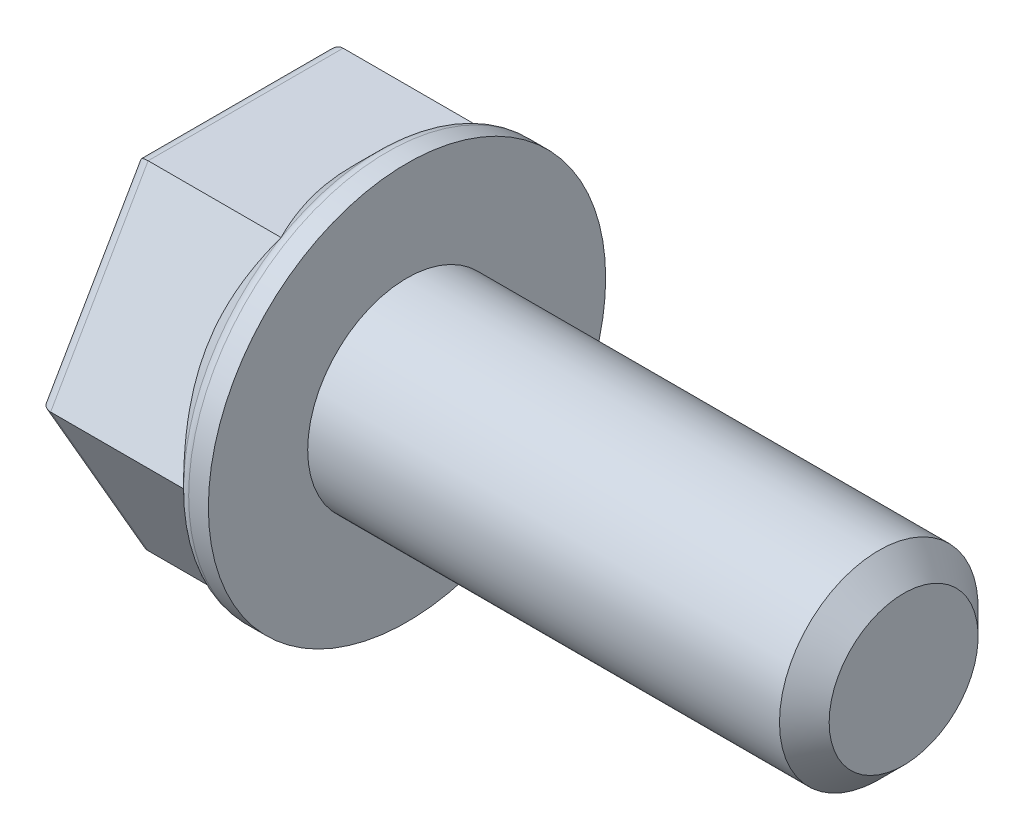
ISO-10303-21;
HEADER;
FILE_DESCRIPTION(('STEP AP214'),'2;1');
FILE_NAME('part.step','',(''),(''),'','','');
FILE_SCHEMA(('AUTOMOTIVE_DESIGN { 1 0 10303 214 1 1 1 1 }'));
ENDSEC;
DATA;
#1=APPLICATION_CONTEXT('core data for automotive mechanical design processes');
#2=APPLICATION_PROTOCOL_DEFINITION('international standard','automotive_design',2000,#1);
#3=PRODUCT_CONTEXT('',#1,'mechanical');
#4=PRODUCT('Part','Part','',(#3));
#5=PRODUCT_RELATED_PRODUCT_CATEGORY('part','',(#4));
#6=PRODUCT_DEFINITION_FORMATION('','',#4);
#7=PRODUCT_DEFINITION_CONTEXT('part definition',#1,'design');
#8=PRODUCT_DEFINITION('design','',#6,#7);
#9=PRODUCT_DEFINITION_SHAPE('','',#8);
#10=(LENGTH_UNIT() NAMED_UNIT(*) SI_UNIT(.MILLI.,.METRE.));
#11=(NAMED_UNIT(*) PLANE_ANGLE_UNIT() SI_UNIT($,.RADIAN.));
#12=(NAMED_UNIT(*) SI_UNIT($,.STERADIAN.) SOLID_ANGLE_UNIT());
#13=UNCERTAINTY_MEASURE_WITH_UNIT(LENGTH_MEASURE(1.E-05),#10,'distance_accuracy_value','');
#14=(GEOMETRIC_REPRESENTATION_CONTEXT(3) GLOBAL_UNCERTAINTY_ASSIGNED_CONTEXT((#13)) GLOBAL_UNIT_ASSIGNED_CONTEXT((#10,
#11,#12)) REPRESENTATION_CONTEXT('',''));
#15=CARTESIAN_POINT('',(0.,0.,0.));
#16=DIRECTION('',(0.,0.,1.));
#17=DIRECTION('',(1.,0.,0.));
#18=AXIS2_PLACEMENT_3D('',#15,#16,#17);
#19=CARTESIAN_POINT('',(-3.5,0.,0.));
#20=DIRECTION('',(-1.,0.,0.));
#21=DIRECTION('',(0.,0.,1.));
#22=AXIS2_PLACEMENT_3D('',#19,#20,#21);
#23=PLANE('',#22);
#24=CARTESIAN_POINT('',(-3.5,0.,0.));
#25=DIRECTION('',(-1.,0.,0.));
#26=DIRECTION('',(0.,0.,1.));
#27=AXIS2_PLACEMENT_3D('',#24,#25,#26);
#28=CIRCLE('',#27,3.10355339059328);
#29=CARTESIAN_POINT('',(-3.5,0.,3.10355339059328));
#30=VERTEX_POINT('',#29);
#31=EDGE_CURVE('E235',#30,#30,#28,.F.);
#32=ORIENTED_EDGE('',*,*,#31,.T.);
#33=EDGE_LOOP('',(#32));
#34=FACE_BOUND('',#33,.T.);
#35=DIRECTION('',(0.,0.,-1.));
#36=VECTOR('',#35,1.);
#37=CARTESIAN_POINT('',(-3.5,3.15000000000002,0.));
#38=LINE('',#37,#36);
#39=CARTESIAN_POINT('',(-3.5,3.15,1.81865334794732));
#40=VERTEX_POINT('',#39);
#41=CARTESIAN_POINT('',(-3.5,3.15000000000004,-1.81865334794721));
#42=VERTEX_POINT('',#41);
#43=EDGE_CURVE('E230',#40,#42,#38,.T.);
#44=ORIENTED_EDGE('',*,*,#43,.T.);
#45=DIRECTION('',(0.,0.866025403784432,0.500000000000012));
#46=VECTOR('',#45,1.);
#47=CARTESIAN_POINT('',(-3.5,-0.125000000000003,-3.70947547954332));
#48=LINE('',#47,#46);
#49=CARTESIAN_POINT('',(-3.5,0.,-3.63730669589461));
#50=VERTEX_POINT('',#49);
#51=EDGE_CURVE('E232',#42,#50,#48,.F.);
#52=ORIENTED_EDGE('',*,*,#51,.T.);
#53=DIRECTION('',(0.,-0.866025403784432,0.500000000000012));
#54=VECTOR('',#53,1.);
#55=CARTESIAN_POINT('',(-3.5,-1.57500000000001,-2.72798002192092));
#56=LINE('',#55,#54);
#57=CARTESIAN_POINT('',(-3.5,-3.15000000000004,-1.81865334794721));
#58=VERTEX_POINT('',#57);
#59=EDGE_CURVE('E216',#50,#58,#56,.T.);
#60=ORIENTED_EDGE('',*,*,#59,.T.);
#61=DIRECTION('',(0.,0.,-1.));
#62=VECTOR('',#61,1.);
#63=CARTESIAN_POINT('',(-3.5,-3.15,1.96299091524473));
#64=LINE('',#63,#62);
#65=CARTESIAN_POINT('',(-3.5,-3.15,1.81865334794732));
#66=VERTEX_POINT('',#65);
#67=EDGE_CURVE('E219',#58,#66,#64,.F.);
#68=ORIENTED_EDGE('',*,*,#67,.T.);
#69=DIRECTION('',(0.,-0.86602540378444,-0.499999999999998));
#70=VECTOR('',#69,1.);
#71=CARTESIAN_POINT('',(-3.5,0.125,3.70947547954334));
#72=LINE('',#71,#70);
#73=CARTESIAN_POINT('',(-3.5,0.,3.63730669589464));
#74=VERTEX_POINT('',#73);
#75=EDGE_CURVE('E226',#66,#74,#72,.F.);
#76=ORIENTED_EDGE('',*,*,#75,.T.);
#77=DIRECTION('',(0.,0.86602540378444,-0.499999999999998));
#78=VECTOR('',#77,1.);
#79=CARTESIAN_POINT('',(-3.5,1.57499999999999,2.72798002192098));
#80=LINE('',#79,#78);
#81=EDGE_CURVE('E228',#74,#40,#80,.T.);
#82=ORIENTED_EDGE('',*,*,#81,.T.);
#83=EDGE_LOOP('',(#44,#52,#60,#68,#76,#82));
#84=FACE_BOUND('',#83,.T.);
#85=ADVANCED_FACE('F34',(#34,#84),#23,.T.);
#86=CARTESIAN_POINT('',(-1.5,0.,0.));
#87=DIRECTION('',(1.,0.,0.));
#88=DIRECTION('',(0.,0.,-1.));
#89=AXIS2_PLACEMENT_3D('',#86,#87,#88);
#90=CONICAL_SURFACE('',#89,3.,0.785398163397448);
#91=CARTESIAN_POINT('',(-0.573223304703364,0.,0.));
#92=DIRECTION('',(-1.,0.,0.));
#93=DIRECTION('',(0.,0.,1.));
#94=AXIS2_PLACEMENT_3D('',#91,#92,#93);
#95=CIRCLE('',#94,3.92677669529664);
#96=CARTESIAN_POINT('',(-0.573223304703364,0.,3.92677669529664));
#97=VERTEX_POINT('',#96);
#98=EDGE_CURVE('E43',#97,#97,#95,.T.);
#99=ORIENTED_EDGE('',*,*,#98,.T.);
#100=EDGE_LOOP('',(#99));
#101=FACE_BOUND('',#100,.T.);
#102=CARTESIAN_POINT('',(-0.573902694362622,0.0002,-3.92609730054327));
#103=CARTESIAN_POINT('',(-0.641319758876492,-0.116671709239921,-3.85862138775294));
#104=CARTESIAN_POINT('',(-0.704777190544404,-0.23549764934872,-3.79001719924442));
#105=CARTESIAN_POINT('',(-0.820966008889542,-0.47779664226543,-3.65012581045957));
#106=CARTESIAN_POINT('',(-0.873632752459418,-0.60129273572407,-3.57882530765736));
#107=CARTESIAN_POINT('',(-0.963851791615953,-0.850316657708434,-3.43505127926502));
#108=CARTESIAN_POINT('',(-1.00163083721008,-0.975781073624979,-3.36261436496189));
#109=CARTESIAN_POINT('',(-1.05983713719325,-1.22947191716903,-3.21614588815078));
#110=CARTESIAN_POINT('',(-1.08030783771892,-1.35769059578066,-3.14211879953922));
#111=CARTESIAN_POINT('',(-1.09877789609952,-1.57867115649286,-3.01453561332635));
#112=CARTESIAN_POINT('',(-1.10151193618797,-1.67114767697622,-2.96114426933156));
#113=CARTESIAN_POINT('',(-1.09690453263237,-1.85595028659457,-2.85444843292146));
#114=CARTESIAN_POINT('',(-1.08955955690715,-1.94827631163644,-2.80114397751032));
#115=CARTESIAN_POINT('',(-1.06521350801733,-2.13205366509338,-2.695040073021));
#116=CARTESIAN_POINT('',(-1.04820163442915,-2.22350389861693,-2.64224125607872));
#117=CARTESIAN_POINT('',(-1.0054503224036,-2.40483373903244,-2.53755042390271));
#118=CARTESIAN_POINT('',(-0.979711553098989,-2.49471346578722,-2.48565833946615));
#119=CARTESIAN_POINT('',(-0.926755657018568,-2.65427457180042,-2.39353569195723));
#120=CARTESIAN_POINT('',(-0.900930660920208,-2.72430916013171,-2.35310120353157));
#121=CARTESIAN_POINT('',(-0.845118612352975,-2.8631210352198,-2.27295813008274));
#122=CARTESIAN_POINT('',(-0.815131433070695,-2.93189828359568,-2.23324956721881));
#123=CARTESIAN_POINT('',(-0.751667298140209,-3.06797879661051,-2.15468344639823));
#124=CARTESIAN_POINT('',(-0.71820131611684,-3.13528593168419,-2.11582365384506));
#125=CARTESIAN_POINT('',(-0.648219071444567,-3.26865369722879,-2.03882373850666));
#126=CARTESIAN_POINT('',(-0.611704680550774,-3.33471506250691,-2.0006831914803));
#127=CARTESIAN_POINT('',(-0.573902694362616,-3.40020000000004,-1.96287544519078));
#128=B_SPLINE_CURVE_WITH_KNOTS('',3,(#102,#103,#104,#105,#106,#107,#108,#109,#110,#111,#112,
#113,#114,#115,#116,#117,#118,#119,#120,#121,#122,#123,#124,#125,#126,#127),.UNSPECIFIED.,.F.,
.F.,(4,2,2,2,2,2,2,2,2,2,2,2,4),(0.,0.452876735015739,0.9083919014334,1.35667302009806,
1.80382552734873,2.12382555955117,2.44393776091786,2.76440831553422,3.08485430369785,
3.33941214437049,3.59397774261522,3.84776339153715,4.10139434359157),.UNSPECIFIED.);
#129=CARTESIAN_POINT('',(-0.574018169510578,0.,-3.92598183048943));
#130=VERTEX_POINT('',#129);
#131=CARTESIAN_POINT('',(-0.574018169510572,-3.40000000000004,-1.96299091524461));
#132=VERTEX_POINT('',#131);
#133=EDGE_CURVE('E173',#130,#132,#128,.T.);
#134=ORIENTED_EDGE('',*,*,#133,.F.);
#135=CARTESIAN_POINT('',(-0.573902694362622,-0.0002,-3.92609730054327));
#136=CARTESIAN_POINT('',(-0.641319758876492,0.116671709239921,-3.85862138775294));
#137=CARTESIAN_POINT('',(-0.704777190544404,0.23549764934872,-3.79001719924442));
#138=CARTESIAN_POINT('',(-0.820966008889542,0.47779664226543,-3.65012581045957));
#139=CARTESIAN_POINT('',(-0.873632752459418,0.60129273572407,-3.57882530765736));
#140=CARTESIAN_POINT('',(-0.963851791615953,0.850316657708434,-3.43505127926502));
#141=CARTESIAN_POINT('',(-1.00163083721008,0.975781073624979,-3.36261436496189));
#142=CARTESIAN_POINT('',(-1.05983713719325,1.22947191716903,-3.21614588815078));
#143=CARTESIAN_POINT('',(-1.08030783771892,1.35769059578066,-3.14211879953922));
#144=CARTESIAN_POINT('',(-1.09877789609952,1.57867115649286,-3.01453561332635));
#145=CARTESIAN_POINT('',(-1.10151193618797,1.67114767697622,-2.96114426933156));
#146=CARTESIAN_POINT('',(-1.09690453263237,1.85595028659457,-2.85444843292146));
#147=CARTESIAN_POINT('',(-1.08955955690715,1.94827631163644,-2.80114397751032));
#148=CARTESIAN_POINT('',(-1.06521350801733,2.13205366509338,-2.695040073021));
#149=CARTESIAN_POINT('',(-1.04820163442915,2.22350389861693,-2.64224125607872));
#150=CARTESIAN_POINT('',(-1.0054503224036,2.40483373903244,-2.53755042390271));
#151=CARTESIAN_POINT('',(-0.979711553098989,2.49471346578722,-2.48565833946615));
#152=CARTESIAN_POINT('',(-0.926755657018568,2.65427457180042,-2.39353569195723));
#153=CARTESIAN_POINT('',(-0.900930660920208,2.72430916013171,-2.35310120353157));
#154=CARTESIAN_POINT('',(-0.845118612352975,2.8631210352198,-2.27295813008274));
#155=CARTESIAN_POINT('',(-0.815131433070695,2.93189828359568,-2.23324956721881));
#156=CARTESIAN_POINT('',(-0.751667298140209,3.06797879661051,-2.15468344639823));
#157=CARTESIAN_POINT('',(-0.71820131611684,3.13528593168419,-2.11582365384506));
#158=CARTESIAN_POINT('',(-0.648219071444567,3.26865369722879,-2.03882373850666));
#159=CARTESIAN_POINT('',(-0.611704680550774,3.33471506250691,-2.0006831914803));
#160=CARTESIAN_POINT('',(-0.573902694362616,3.40020000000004,-1.96287544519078));
#161=B_SPLINE_CURVE_WITH_KNOTS('',3,(#135,#136,#137,#138,#139,#140,#141,#142,#143,#144,#145,
#146,#147,#148,#149,#150,#151,#152,#153,#154,#155,#156,#157,#158,#159,#160),.UNSPECIFIED.,.F.,
.F.,(4,2,2,2,2,2,2,2,2,2,2,2,4),(0.,0.452876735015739,0.9083919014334,1.35667302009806,
1.80382552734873,2.12382555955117,2.44393776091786,2.76440831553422,3.08485430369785,
3.33941214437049,3.59397774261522,3.84776339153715,4.10139434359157),.UNSPECIFIED.);
#162=CARTESIAN_POINT('',(-0.574018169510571,3.40000000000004,-1.96299091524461));
#163=VERTEX_POINT('',#162);
#164=EDGE_CURVE('E166',#130,#163,#161,.T.);
#165=ORIENTED_EDGE('',*,*,#164,.T.);
#166=CARTESIAN_POINT('',(0.724042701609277,3.40000000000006,-3.96618483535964));
#167=CARTESIAN_POINT('',(0.650912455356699,3.40000000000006,-3.86983982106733));
#168=CARTESIAN_POINT('',(0.578473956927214,3.40000000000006,-3.7729611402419));
#169=CARTESIAN_POINT('',(0.435291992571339,3.40000000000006,-3.57792374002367));
#170=CARTESIAN_POINT('',(0.364548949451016,3.40000000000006,-3.47976471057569));
#171=CARTESIAN_POINT('',(0.224566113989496,3.40000000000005,-3.28123579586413));
#172=CARTESIAN_POINT('',(0.155342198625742,3.40000000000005,-3.18085467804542));
#173=CARTESIAN_POINT('',(0.0194269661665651,3.40000000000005,-2.97839764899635));
#174=CARTESIAN_POINT('',(-0.0472645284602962,3.40000000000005,-2.87632185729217));
#175=CARTESIAN_POINT('',(-0.18138517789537,3.40000000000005,-2.66413015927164));
#176=CARTESIAN_POINT('',(-0.248626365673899,3.40000000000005,-2.55389483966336));
#177=CARTESIAN_POINT('',(-0.378758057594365,3.40000000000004,-2.33084584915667));
#178=CARTESIAN_POINT('',(-0.441647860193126,3.40000000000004,-2.21803176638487));
#179=CARTESIAN_POINT('',(-0.561724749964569,3.40000000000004,-1.98982394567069));
#180=CARTESIAN_POINT('',(-0.618928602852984,3.40000000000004,-1.87443909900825));
#181=CARTESIAN_POINT('',(-0.726352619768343,3.40000000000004,-1.64048900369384));
#182=CARTESIAN_POINT('',(-0.776575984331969,3.40000000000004,-1.52192524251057));
#183=CARTESIAN_POINT('',(-0.864306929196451,3.40000000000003,-1.29173731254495));
#184=CARTESIAN_POINT('',(-0.902535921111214,3.40000000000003,-1.18039095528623));
#185=CARTESIAN_POINT('',(-0.970067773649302,3.40000000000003,-0.954972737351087));
#186=CARTESIAN_POINT('',(-0.999370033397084,3.40000000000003,-0.840900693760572));
#187=CARTESIAN_POINT('',(-1.04701510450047,3.40000000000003,-0.612634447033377));
#188=CARTESIAN_POINT('',(-1.06554884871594,3.40000000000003,-0.498480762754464));
#189=CARTESIAN_POINT('',(-1.09128902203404,3.40000000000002,-0.268896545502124));
#190=CARTESIAN_POINT('',(-1.09849750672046,3.40000000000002,-0.153466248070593));
#191=CARTESIAN_POINT('',(-1.10102911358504,3.40000000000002,0.0731088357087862));
#192=CARTESIAN_POINT('',(-1.09679596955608,3.40000000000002,0.18424879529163));
#193=CARTESIAN_POINT('',(-1.07766937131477,3.40000000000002,0.40560151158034));
#194=CARTESIAN_POINT('',(-1.06277489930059,3.40000000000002,0.515814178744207));
#195=CARTESIAN_POINT('',(-1.02289334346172,3.40000000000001,0.736378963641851));
#196=CARTESIAN_POINT('',(-0.997732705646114,3.40000000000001,0.846699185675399));
#197=CARTESIAN_POINT('',(-0.938675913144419,3.40000000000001,1.06492923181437));
#198=CARTESIAN_POINT('',(-0.904780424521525,3.40000000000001,1.1728392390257));
#199=CARTESIAN_POINT('',(-0.826580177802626,3.40000000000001,1.39488118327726));
#200=CARTESIAN_POINT('',(-0.7816462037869,3.4,1.50878918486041));
#201=CARTESIAN_POINT('',(-0.684871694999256,3.4,1.73364085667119));
#202=CARTESIAN_POINT('',(-0.633028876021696,3.4,1.84458353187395));
#203=CARTESIAN_POINT('',(-0.523660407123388,3.4,2.06406368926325));
#204=CARTESIAN_POINT('',(-0.466116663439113,3.4,2.17259208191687));
#205=CARTESIAN_POINT('',(-0.346619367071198,3.4,2.38715476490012));
#206=CARTESIAN_POINT('',(-0.284666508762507,3.39999999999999,2.49318944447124));
#207=CARTESIAN_POINT('',(-0.160379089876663,3.39999999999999,2.69788580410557));
#208=CARTESIAN_POINT('',(-0.0982161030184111,3.39999999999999,2.7966522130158));
#209=CARTESIAN_POINT('',(0.0287343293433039,3.39999999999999,2.99248898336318));
#210=CARTESIAN_POINT('',(0.0935219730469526,3.39999999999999,3.08955921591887));
#211=CARTESIAN_POINT('',(0.224720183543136,3.39999999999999,3.28144047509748));
#212=CARTESIAN_POINT('',(0.291113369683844,3.39999999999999,3.37626342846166));
#213=CARTESIAN_POINT('',(0.425663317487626,3.39999999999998,3.56461182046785));
#214=CARTESIAN_POINT('',(0.493819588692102,3.39999999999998,3.65813760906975));
#215=CARTESIAN_POINT('',(0.562696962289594,3.39999999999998,3.75111990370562));
#216=B_SPLINE_CURVE_WITH_KNOTS('',3,(#166,#167,#168,#169,#170,#171,#172,#173,#174,#175,#176,
#177,#178,#179,#180,#181,#182,#183,#184,#185,#186,#187,#188,#189,#190,#191,#192,#193,#194,#195,
#196,#197,#198,#199,#200,#201,#202,#203,#204,#205,#206,#207,#208,#209,#210,#211,#212,#213,#214,
#215),.UNSPECIFIED.,.F.,.F.,(4,2,2,2,2,2,2,2,2,2,2,2,2,2,2,2,2,2,2,2,2,2,2,2,4),(0.,
0.362875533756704,0.725840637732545,1.0916156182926,1.45736490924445,1.84465932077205,
2.2320160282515,2.61819439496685,3.00419511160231,3.35706531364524,3.70995926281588,
4.05638854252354,4.40275493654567,4.73588304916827,5.06904296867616,5.40808522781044,
5.74710164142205,6.11416815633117,6.48135633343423,6.84974970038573,7.21808517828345,
7.56813839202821,7.9182180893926,8.26546420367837,8.61261473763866),.UNSPECIFIED.);
#217=CARTESIAN_POINT('',(-0.574018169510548,3.4,1.96299091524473));
#218=VERTEX_POINT('',#217);
#219=EDGE_CURVE('E125',#218,#163,#216,.F.);
#220=ORIENTED_EDGE('',*,*,#219,.F.);
#221=CARTESIAN_POINT('',(-0.5739026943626,-0.000199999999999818,3.92609730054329));
#222=CARTESIAN_POINT('',(-0.641319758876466,0.11667170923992,3.85862138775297));
#223=CARTESIAN_POINT('',(-0.704777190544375,0.235497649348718,3.79001719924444));
#224=CARTESIAN_POINT('',(-0.820966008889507,0.477796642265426,3.65012581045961));
#225=CARTESIAN_POINT('',(-0.87363275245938,0.601292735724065,3.5788253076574));
#226=CARTESIAN_POINT('',(-0.963851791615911,0.850316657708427,3.43505127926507));
#227=CARTESIAN_POINT('',(-1.00163083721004,0.97578107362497,3.36261436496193));
#228=CARTESIAN_POINT('',(-1.0598371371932,1.22947191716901,3.21614588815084));
#229=CARTESIAN_POINT('',(-1.08030783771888,1.35769059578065,3.14211879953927));
#230=CARTESIAN_POINT('',(-1.09877789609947,1.57867115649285,3.01453561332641));
#231=CARTESIAN_POINT('',(-1.10151193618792,1.67114767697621,2.96114426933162));
#232=CARTESIAN_POINT('',(-1.09690453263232,1.85595028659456,2.85444843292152));
#233=CARTESIAN_POINT('',(-1.0895595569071,1.94827631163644,2.80114397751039));
#234=CARTESIAN_POINT('',(-1.06521350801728,2.13205366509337,2.69504007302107));
#235=CARTESIAN_POINT('',(-1.04820163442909,2.22350389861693,2.64224125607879));
#236=CARTESIAN_POINT('',(-1.00545032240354,2.40483373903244,2.53755042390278));
#237=CARTESIAN_POINT('',(-0.979711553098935,2.49471346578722,2.48565833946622));
#238=CARTESIAN_POINT('',(-0.926755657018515,2.65427457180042,2.39353569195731));
#239=CARTESIAN_POINT('',(-0.900930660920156,2.72430916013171,2.35310120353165));
#240=CARTESIAN_POINT('',(-0.845118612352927,2.86312103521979,2.27295813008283));
#241=CARTESIAN_POINT('',(-0.81513143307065,2.93189828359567,2.2332495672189));
#242=CARTESIAN_POINT('',(-0.75166729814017,3.06797879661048,2.15468344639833));
#243=CARTESIAN_POINT('',(-0.718201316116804,3.13528593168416,2.11582365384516));
#244=CARTESIAN_POINT('',(-0.648219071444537,3.26865369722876,2.03882373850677));
#245=CARTESIAN_POINT('',(-0.611704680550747,3.33471506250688,2.00068319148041));
#246=CARTESIAN_POINT('',(-0.573902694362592,3.4002,1.96287544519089));
#247=B_SPLINE_CURVE_WITH_KNOTS('',3,(#221,#222,#223,#224,#225,#226,#227,#228,#229,#230,#231,
#232,#233,#234,#235,#236,#237,#238,#239,#240,#241,#242,#243,#244,#245,#246),.UNSPECIFIED.,.F.,
.F.,(4,2,2,2,2,2,2,2,2,2,2,2,4),(0.,0.452876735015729,0.90839190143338,1.35667302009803,
1.80382552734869,2.12382555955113,2.44393776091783,2.76440831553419,3.08485430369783,
3.33941214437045,3.59397774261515,3.84776339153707,4.10139434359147),.UNSPECIFIED.);
#248=CARTESIAN_POINT('',(-0.574018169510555,0.,3.92598183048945));
#249=VERTEX_POINT('',#248);
#250=EDGE_CURVE('E123',#249,#218,#247,.T.);
#251=ORIENTED_EDGE('',*,*,#250,.F.);
#252=CARTESIAN_POINT('',(-0.5739026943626,0.000200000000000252,3.92609730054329));
#253=CARTESIAN_POINT('',(-0.641319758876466,-0.11667170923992,3.85862138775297));
#254=CARTESIAN_POINT('',(-0.704777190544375,-0.235497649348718,3.79001719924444));
#255=CARTESIAN_POINT('',(-0.820966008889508,-0.477796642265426,3.65012581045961));
#256=CARTESIAN_POINT('',(-0.873632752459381,-0.601292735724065,3.5788253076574));
#257=CARTESIAN_POINT('',(-0.963851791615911,-0.850316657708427,3.43505127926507));
#258=CARTESIAN_POINT('',(-1.00163083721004,-0.97578107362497,3.36261436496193));
#259=CARTESIAN_POINT('',(-1.0598371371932,-1.22947191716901,3.21614588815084));
#260=CARTESIAN_POINT('',(-1.08030783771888,-1.35769059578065,3.14211879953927));
#261=CARTESIAN_POINT('',(-1.09877789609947,-1.57867115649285,3.01453561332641));
#262=CARTESIAN_POINT('',(-1.10151193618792,-1.67114767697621,2.96114426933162));
#263=CARTESIAN_POINT('',(-1.09690453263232,-1.85595028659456,2.85444843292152));
#264=CARTESIAN_POINT('',(-1.0895595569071,-1.94827631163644,2.80114397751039));
#265=CARTESIAN_POINT('',(-1.06521350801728,-2.13205366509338,2.69504007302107));
#266=CARTESIAN_POINT('',(-1.04820163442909,-2.22350389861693,2.64224125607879));
#267=CARTESIAN_POINT('',(-1.00545032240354,-2.40483373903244,2.53755042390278));
#268=CARTESIAN_POINT('',(-0.979711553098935,-2.49471346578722,2.48565833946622));
#269=CARTESIAN_POINT('',(-0.926755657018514,-2.65427457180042,2.39353569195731));
#270=CARTESIAN_POINT('',(-0.900930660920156,-2.72430916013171,2.35310120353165));
#271=CARTESIAN_POINT('',(-0.845118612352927,-2.86312103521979,2.27295813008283));
#272=CARTESIAN_POINT('',(-0.81513143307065,-2.93189828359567,2.2332495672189));
#273=CARTESIAN_POINT('',(-0.751667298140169,-3.06797879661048,2.15468344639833));
#274=CARTESIAN_POINT('',(-0.718201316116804,-3.13528593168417,2.11582365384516));
#275=CARTESIAN_POINT('',(-0.648219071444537,-3.26865369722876,2.03882373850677));
#276=CARTESIAN_POINT('',(-0.611704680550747,-3.33471506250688,2.00068319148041));
#277=CARTESIAN_POINT('',(-0.573902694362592,-3.4002,1.96287544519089));
#278=B_SPLINE_CURVE_WITH_KNOTS('',3,(#252,#253,#254,#255,#256,#257,#258,#259,#260,#261,#262,
#263,#264,#265,#266,#267,#268,#269,#270,#271,#272,#273,#274,#275,#276,#277),.UNSPECIFIED.,.F.,
.F.,(4,2,2,2,2,2,2,2,2,2,2,2,4),(0.,0.452876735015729,0.90839190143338,1.35667302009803,
1.80382552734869,2.12382555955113,2.44393776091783,2.7644083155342,3.08485430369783,
3.33941214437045,3.59397774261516,3.84776339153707,4.10139434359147),.UNSPECIFIED.);
#279=CARTESIAN_POINT('',(-0.574018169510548,-3.4,1.96299091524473));
#280=VERTEX_POINT('',#279);
#281=EDGE_CURVE('E115',#249,#280,#278,.T.);
#282=ORIENTED_EDGE('',*,*,#281,.T.);
#283=CARTESIAN_POINT('',(0.724042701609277,-3.40000000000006,-3.96618483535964));
#284=CARTESIAN_POINT('',(0.650912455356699,-3.40000000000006,-3.86983982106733));
#285=CARTESIAN_POINT('',(0.578473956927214,-3.40000000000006,-3.7729611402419));
#286=CARTESIAN_POINT('',(0.435291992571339,-3.40000000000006,-3.57792374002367));
#287=CARTESIAN_POINT('',(0.364548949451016,-3.40000000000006,-3.47976471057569));
#288=CARTESIAN_POINT('',(0.224566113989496,-3.40000000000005,-3.28123579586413));
#289=CARTESIAN_POINT('',(0.155342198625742,-3.40000000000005,-3.18085467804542));
#290=CARTESIAN_POINT('',(0.0194269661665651,-3.40000000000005,-2.97839764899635));
#291=CARTESIAN_POINT('',(-0.0472645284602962,-3.40000000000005,-2.87632185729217));
#292=CARTESIAN_POINT('',(-0.18138517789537,-3.40000000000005,-2.66413015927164));
#293=CARTESIAN_POINT('',(-0.248626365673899,-3.40000000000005,-2.55389483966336));
#294=CARTESIAN_POINT('',(-0.378758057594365,-3.40000000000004,-2.33084584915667));
#295=CARTESIAN_POINT('',(-0.441647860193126,-3.40000000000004,-2.21803176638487));
#296=CARTESIAN_POINT('',(-0.561724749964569,-3.40000000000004,-1.98982394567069));
#297=CARTESIAN_POINT('',(-0.618928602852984,-3.40000000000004,-1.87443909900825));
#298=CARTESIAN_POINT('',(-0.726352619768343,-3.40000000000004,-1.64048900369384));
#299=CARTESIAN_POINT('',(-0.776575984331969,-3.40000000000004,-1.52192524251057));
#300=CARTESIAN_POINT('',(-0.864306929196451,-3.40000000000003,-1.29173731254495));
#301=CARTESIAN_POINT('',(-0.902535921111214,-3.40000000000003,-1.18039095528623));
#302=CARTESIAN_POINT('',(-0.970067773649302,-3.40000000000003,-0.954972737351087));
#303=CARTESIAN_POINT('',(-0.999370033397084,-3.40000000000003,-0.840900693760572));
#304=CARTESIAN_POINT('',(-1.04701510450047,-3.40000000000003,-0.612634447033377));
#305=CARTESIAN_POINT('',(-1.06554884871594,-3.40000000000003,-0.498480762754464));
#306=CARTESIAN_POINT('',(-1.09128902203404,-3.40000000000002,-0.268896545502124));
#307=CARTESIAN_POINT('',(-1.09849750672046,-3.40000000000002,-0.153466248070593));
#308=CARTESIAN_POINT('',(-1.10102911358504,-3.40000000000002,0.0731088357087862));
#309=CARTESIAN_POINT('',(-1.09679596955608,-3.40000000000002,0.18424879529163));
#310=CARTESIAN_POINT('',(-1.07766937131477,-3.40000000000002,0.40560151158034));
#311=CARTESIAN_POINT('',(-1.06277489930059,-3.40000000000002,0.515814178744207));
#312=CARTESIAN_POINT('',(-1.02289334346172,-3.40000000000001,0.736378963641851));
#313=CARTESIAN_POINT('',(-0.997732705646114,-3.40000000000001,0.846699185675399));
#314=CARTESIAN_POINT('',(-0.938675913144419,-3.40000000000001,1.06492923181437));
#315=CARTESIAN_POINT('',(-0.904780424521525,-3.40000000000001,1.1728392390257));
#316=CARTESIAN_POINT('',(-0.826580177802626,-3.40000000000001,1.39488118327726));
#317=CARTESIAN_POINT('',(-0.7816462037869,-3.4,1.50878918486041));
#318=CARTESIAN_POINT('',(-0.684871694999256,-3.4,1.73364085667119));
#319=CARTESIAN_POINT('',(-0.633028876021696,-3.4,1.84458353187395));
#320=CARTESIAN_POINT('',(-0.523660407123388,-3.4,2.06406368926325));
#321=CARTESIAN_POINT('',(-0.466116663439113,-3.4,2.17259208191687));
#322=CARTESIAN_POINT('',(-0.346619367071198,-3.4,2.38715476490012));
#323=CARTESIAN_POINT('',(-0.284666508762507,-3.39999999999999,2.49318944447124));
#324=CARTESIAN_POINT('',(-0.160379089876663,-3.39999999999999,2.69788580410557));
#325=CARTESIAN_POINT('',(-0.0982161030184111,-3.39999999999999,2.7966522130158));
#326=CARTESIAN_POINT('',(0.0287343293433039,-3.39999999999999,2.99248898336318));
#327=CARTESIAN_POINT('',(0.0935219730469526,-3.39999999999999,3.08955921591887));
#328=CARTESIAN_POINT('',(0.224720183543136,-3.39999999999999,3.28144047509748));
#329=CARTESIAN_POINT('',(0.291113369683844,-3.39999999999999,3.37626342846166));
#330=CARTESIAN_POINT('',(0.425663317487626,-3.39999999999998,3.56461182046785));
#331=CARTESIAN_POINT('',(0.493819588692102,-3.39999999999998,3.65813760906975));
#332=CARTESIAN_POINT('',(0.562696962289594,-3.39999999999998,3.75111990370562));
#333=B_SPLINE_CURVE_WITH_KNOTS('',3,(#283,#284,#285,#286,#287,#288,#289,#290,#291,#292,#293,
#294,#295,#296,#297,#298,#299,#300,#301,#302,#303,#304,#305,#306,#307,#308,#309,#310,#311,#312,
#313,#314,#315,#316,#317,#318,#319,#320,#321,#322,#323,#324,#325,#326,#327,#328,#329,#330,#331,
#332),.UNSPECIFIED.,.F.,.F.,(4,2,2,2,2,2,2,2,2,2,2,2,2,2,2,2,2,2,2,2,2,2,2,2,4),(0.,
0.362875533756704,0.725840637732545,1.0916156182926,1.45736490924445,1.84465932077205,
2.2320160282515,2.61819439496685,3.00419511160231,3.35706531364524,3.70995926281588,
4.05638854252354,4.40275493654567,4.73588304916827,5.06904296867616,5.40808522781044,
5.74710164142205,6.11416815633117,6.48135633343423,6.84974970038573,7.21808517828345,
7.56813839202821,7.9182180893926,8.26546420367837,8.61261473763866),.UNSPECIFIED.);
#334=EDGE_CURVE('E106',#280,#132,#333,.F.);
#335=ORIENTED_EDGE('',*,*,#334,.T.);
#336=EDGE_LOOP('',(#134,#165,#220,#251,#282,#335));
#337=FACE_BOUND('',#336,.T.);
#338=ADVANCED_FACE('F36',(#101,#337),#90,.T.);
#339=CARTESIAN_POINT('',(-16.,0.,0.));
#340=DIRECTION('',(-1.,0.,0.));
#341=DIRECTION('',(0.,0.,1.));
#342=AXIS2_PLACEMENT_3D('',#339,#340,#341);
#343=CYLINDRICAL_SURFACE('',#342,4.);
#344=CARTESIAN_POINT('',(-0.396446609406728,0.,0.));
#345=DIRECTION('',(1.,0.,0.));
#346=DIRECTION('',(0.,0.,-1.));
#347=AXIS2_PLACEMENT_3D('',#344,#345,#346);
#348=CIRCLE('',#347,4.);
#349=CARTESIAN_POINT('',(-0.396446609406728,0.,-4.));
#350=VERTEX_POINT('',#349);
#351=EDGE_CURVE('E11',#350,#350,#348,.T.);
#352=ORIENTED_EDGE('',*,*,#351,.T.);
#353=EDGE_LOOP('',(#352));
#354=FACE_BOUND('',#353,.T.);
#355=CARTESIAN_POINT('',(0.,0.,0.));
#356=DIRECTION('',(-1.,0.,0.));
#357=DIRECTION('',(0.,0.,1.));
#358=AXIS2_PLACEMENT_3D('',#355,#356,#357);
#359=CIRCLE('',#358,4.);
#360=CARTESIAN_POINT('',(0.,0.,4.));
#361=VERTEX_POINT('',#360);
#362=EDGE_CURVE('E215',#361,#361,#359,.T.);
#363=ORIENTED_EDGE('',*,*,#362,.T.);
#364=EDGE_LOOP('',(#363));
#365=FACE_BOUND('',#364,.T.);
#366=ADVANCED_FACE('F203',(#354,#365),#343,.T.);
#367=CARTESIAN_POINT('',(0.,4.,0.));
#368=DIRECTION('',(1.,0.,0.));
#369=DIRECTION('',(0.,0.,-1.));
#370=AXIS2_PLACEMENT_3D('',#367,#368,#369);
#371=PLANE('',#370);
#372=ORIENTED_EDGE('',*,*,#362,.F.);
#373=EDGE_LOOP('',(#372));
#374=FACE_BOUND('',#373,.T.);
#375=CARTESIAN_POINT('',(0.,0.,0.));
#376=DIRECTION('',(-1.,0.,0.));
#377=DIRECTION('',(0.,0.,1.));
#378=AXIS2_PLACEMENT_3D('',#375,#376,#377);
#379=CIRCLE('',#378,2.);
#380=CARTESIAN_POINT('',(0.,0.,2.));
#381=VERTEX_POINT('',#380);
#382=EDGE_CURVE('E217',#381,#381,#379,.T.);
#383=ORIENTED_EDGE('',*,*,#382,.T.);
#384=EDGE_LOOP('',(#383));
#385=FACE_BOUND('',#384,.T.);
#386=ADVANCED_FACE('F200',(#374,#385),#371,.T.);
#387=CARTESIAN_POINT('',(-16.,0.,0.));
#388=DIRECTION('',(-1.,0.,0.));
#389=DIRECTION('',(0.,0.,1.));
#390=AXIS2_PLACEMENT_3D('',#387,#388,#389);
#391=CYLINDRICAL_SURFACE('',#390,2.);
#392=CARTESIAN_POINT('',(9.50000000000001,0.,0.));
#393=DIRECTION('',(-1.,0.,0.));
#394=DIRECTION('',(0.,0.,1.));
#395=AXIS2_PLACEMENT_3D('',#392,#393,#394);
#396=CIRCLE('',#395,2.);
#397=CARTESIAN_POINT('',(9.50000000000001,0.,2.));
#398=VERTEX_POINT('',#397);
#399=EDGE_CURVE('E222',#398,#398,#396,.T.);
#400=ORIENTED_EDGE('',*,*,#399,.T.);
#401=EDGE_LOOP('',(#400));
#402=FACE_BOUND('',#401,.T.);
#403=ORIENTED_EDGE('',*,*,#382,.F.);
#404=EDGE_LOOP('',(#403));
#405=FACE_BOUND('',#404,.T.);
#406=ADVANCED_FACE('F196',(#402,#405),#391,.T.);
#407=CARTESIAN_POINT('',(9.50000000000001,0.,0.));
#408=DIRECTION('',(-1.,0.,0.));
#409=DIRECTION('',(0.,0.,1.));
#410=AXIS2_PLACEMENT_3D('',#407,#408,#409);
#411=CONICAL_SURFACE('',#410,2.,0.785398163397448);
#412=CARTESIAN_POINT('',(10.,0.,0.));
#413=DIRECTION('',(-1.,0.,0.));
#414=DIRECTION('',(0.,0.,1.));
#415=AXIS2_PLACEMENT_3D('',#412,#413,#414);
#416=CIRCLE('',#415,1.5);
#417=CARTESIAN_POINT('',(10.,0.,1.5));
#418=VERTEX_POINT('',#417);
#419=EDGE_CURVE('E179',#418,#418,#416,.T.);
#420=ORIENTED_EDGE('',*,*,#419,.T.);
#421=EDGE_LOOP('',(#420));
#422=FACE_BOUND('',#421,.T.);
#423=ORIENTED_EDGE('',*,*,#399,.F.);
#424=EDGE_LOOP('',(#423));
#425=FACE_BOUND('',#424,.T.);
#426=ADVANCED_FACE('F192',(#422,#425),#411,.T.);
#427=CARTESIAN_POINT('',(10.,1.5,0.));
#428=DIRECTION('',(1.,0.,0.));
#429=DIRECTION('',(0.,0.,-1.));
#430=AXIS2_PLACEMENT_3D('',#427,#428,#429);
#431=PLANE('',#430);
#432=ORIENTED_EDGE('',*,*,#419,.F.);
#433=EDGE_LOOP('',(#432));
#434=FACE_BOUND('',#433,.T.);
#435=ADVANCED_FACE('F185',(#434),#431,.T.);
#436=CARTESIAN_POINT('',(10.3871715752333,0.,-3.92598183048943));
#437=DIRECTION('',(0.,-0.500000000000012,-0.866025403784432));
#438=DIRECTION('',(0.,0.866025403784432,-0.500000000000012));
#439=AXIS2_PLACEMENT_3D('',#436,#437,#438);
#440=PLANE('',#439);
#441=DIRECTION('',(-1.,0.,0.));
#442=VECTOR('',#441,1.);
#443=CARTESIAN_POINT('',(10.3871715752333,-3.40000000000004,-1.96299091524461));
#444=LINE('',#443,#442);
#445=CARTESIAN_POINT('',(-3.25,-3.40000000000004,-1.96299091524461));
#446=VERTEX_POINT('',#445);
#447=EDGE_CURVE('E110',#132,#446,#444,.T.);
#448=ORIENTED_EDGE('',*,*,#447,.T.);
#449=DIRECTION('',(0.,-0.866025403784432,0.500000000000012));
#450=VECTOR('',#449,1.);
#451=CARTESIAN_POINT('',(-3.25,0.,-3.92598183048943));
#452=LINE('',#451,#450);
#453=CARTESIAN_POINT('',(-3.25,0.,-3.92598183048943));
#454=VERTEX_POINT('',#453);
#455=EDGE_CURVE('E250',#446,#454,#452,.F.);
#456=ORIENTED_EDGE('',*,*,#455,.T.);
#457=DIRECTION('',(-1.,0.,0.));
#458=VECTOR('',#457,1.);
#459=CARTESIAN_POINT('',(10.3871715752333,0.,-3.92598183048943));
#460=LINE('',#459,#458);
#461=EDGE_CURVE('E310',#130,#454,#460,.T.);
#462=ORIENTED_EDGE('',*,*,#461,.F.);
#463=ORIENTED_EDGE('',*,*,#133,.T.);
#464=EDGE_LOOP('',(#448,#456,#462,#463));
#465=FACE_BOUND('',#464,.T.);
#466=ADVANCED_FACE('F181',(#465),#440,.T.);
#467=CARTESIAN_POINT('',(10.3871715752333,0.,-3.92598183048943));
#468=DIRECTION('',(0.,-0.500000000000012,0.866025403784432));
#469=DIRECTION('',(0.,-0.866025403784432,-0.500000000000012));
#470=AXIS2_PLACEMENT_3D('',#467,#468,#469);
#471=PLANE('',#470);
#472=ORIENTED_EDGE('',*,*,#461,.T.);
#473=DIRECTION('',(0.,0.866025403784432,0.500000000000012));
#474=VECTOR('',#473,1.);
#475=CARTESIAN_POINT('',(-3.25,0.,-3.92598183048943));
#476=LINE('',#475,#474);
#477=CARTESIAN_POINT('',(-3.25,3.40000000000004,-1.96299091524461));
#478=VERTEX_POINT('',#477);
#479=EDGE_CURVE('E241',#454,#478,#476,.T.);
#480=ORIENTED_EDGE('',*,*,#479,.T.);
#481=DIRECTION('',(-1.,0.,0.));
#482=VECTOR('',#481,1.);
#483=CARTESIAN_POINT('',(10.3871715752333,3.40000000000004,-1.96299091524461));
#484=LINE('',#483,#482);
#485=EDGE_CURVE('E318',#163,#478,#484,.T.);
#486=ORIENTED_EDGE('',*,*,#485,.F.);
#487=ORIENTED_EDGE('',*,*,#164,.F.);
#488=EDGE_LOOP('',(#472,#480,#486,#487));
#489=FACE_BOUND('',#488,.T.);
#490=ADVANCED_FACE('F157',(#489),#471,.F.);
#491=CARTESIAN_POINT('',(10.3871715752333,3.4,1.96299091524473));
#492=DIRECTION('',(0.,1.,0.));
#493=DIRECTION('',(0.,0.,1.));
#494=AXIS2_PLACEMENT_3D('',#491,#492,#493);
#495=PLANE('',#494);
#496=ORIENTED_EDGE('',*,*,#485,.T.);
#497=DIRECTION('',(0.,0.,-1.));
#498=VECTOR('',#497,1.);
#499=CARTESIAN_POINT('',(-3.25,3.4,1.96299091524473));
#500=LINE('',#499,#498);
#501=CARTESIAN_POINT('',(-3.25,3.4,1.96299091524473));
#502=VERTEX_POINT('',#501);
#503=EDGE_CURVE('E244',#478,#502,#500,.F.);
#504=ORIENTED_EDGE('',*,*,#503,.T.);
#505=DIRECTION('',(-1.,0.,0.));
#506=VECTOR('',#505,1.);
#507=CARTESIAN_POINT('',(10.3871715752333,3.4,1.96299091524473));
#508=LINE('',#507,#506);
#509=EDGE_CURVE('E321',#218,#502,#508,.T.);
#510=ORIENTED_EDGE('',*,*,#509,.F.);
#511=ORIENTED_EDGE('',*,*,#219,.T.);
#512=EDGE_LOOP('',(#496,#504,#510,#511));
#513=FACE_BOUND('',#512,.T.);
#514=ADVANCED_FACE('F152',(#513),#495,.T.);
#515=CARTESIAN_POINT('',(10.3871715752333,0.,3.92598183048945));
#516=DIRECTION('',(0.,0.499999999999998,0.86602540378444));
#517=DIRECTION('',(0.,-0.86602540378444,0.499999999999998));
#518=AXIS2_PLACEMENT_3D('',#515,#516,#517);
#519=PLANE('',#518);
#520=ORIENTED_EDGE('',*,*,#509,.T.);
#521=DIRECTION('',(0.,0.86602540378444,-0.499999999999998));
#522=VECTOR('',#521,1.);
#523=CARTESIAN_POINT('',(-3.25,0.,3.92598183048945));
#524=LINE('',#523,#522);
#525=CARTESIAN_POINT('',(-3.25,0.,3.92598183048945));
#526=VERTEX_POINT('',#525);
#527=EDGE_CURVE('E246',#502,#526,#524,.F.);
#528=ORIENTED_EDGE('',*,*,#527,.T.);
#529=DIRECTION('',(-1.,0.,0.));
#530=VECTOR('',#529,1.);
#531=CARTESIAN_POINT('',(10.3871715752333,0.,3.92598183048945));
#532=LINE('',#531,#530);
#533=EDGE_CURVE('E119',#249,#526,#532,.T.);
#534=ORIENTED_EDGE('',*,*,#533,.F.);
#535=ORIENTED_EDGE('',*,*,#250,.T.);
#536=EDGE_LOOP('',(#520,#528,#534,#535));
#537=FACE_BOUND('',#536,.T.);
#538=ADVANCED_FACE('F146',(#537),#519,.T.);
#539=CARTESIAN_POINT('',(10.3871715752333,0.,3.92598183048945));
#540=DIRECTION('',(0.,0.499999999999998,-0.86602540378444));
#541=DIRECTION('',(0.,0.86602540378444,0.499999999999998));
#542=AXIS2_PLACEMENT_3D('',#539,#540,#541);
#543=PLANE('',#542);
#544=ORIENTED_EDGE('',*,*,#533,.T.);
#545=DIRECTION('',(0.,-0.86602540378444,-0.499999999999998));
#546=VECTOR('',#545,1.);
#547=CARTESIAN_POINT('',(-3.25,0.,3.92598183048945));
#548=LINE('',#547,#546);
#549=CARTESIAN_POINT('',(-3.25,-3.4,1.96299091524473));
#550=VERTEX_POINT('',#549);
#551=EDGE_CURVE('E58',#526,#550,#548,.T.);
#552=ORIENTED_EDGE('',*,*,#551,.T.);
#553=DIRECTION('',(-1.,0.,0.));
#554=VECTOR('',#553,1.);
#555=CARTESIAN_POINT('',(10.3871715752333,-3.4,1.96299091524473));
#556=LINE('',#555,#554);
#557=EDGE_CURVE('E108',#280,#550,#556,.T.);
#558=ORIENTED_EDGE('',*,*,#557,.F.);
#559=ORIENTED_EDGE('',*,*,#281,.F.);
#560=EDGE_LOOP('',(#544,#552,#558,#559));
#561=FACE_BOUND('',#560,.T.);
#562=ADVANCED_FACE('F117',(#561),#543,.F.);
#563=CARTESIAN_POINT('',(10.3871715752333,-3.4,1.96299091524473));
#564=DIRECTION('',(0.,1.,0.));
#565=DIRECTION('',(0.,0.,1.));
#566=AXIS2_PLACEMENT_3D('',#563,#564,#565);
#567=PLANE('',#566);
#568=ORIENTED_EDGE('',*,*,#557,.T.);
#569=DIRECTION('',(0.,0.,-1.));
#570=VECTOR('',#569,1.);
#571=CARTESIAN_POINT('',(-3.25,-3.4,1.96299091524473));
#572=LINE('',#571,#570);
#573=EDGE_CURVE('E50',#550,#446,#572,.T.);
#574=ORIENTED_EDGE('',*,*,#573,.T.);
#575=ORIENTED_EDGE('',*,*,#447,.F.);
#576=ORIENTED_EDGE('',*,*,#334,.F.);
#577=EDGE_LOOP('',(#568,#574,#575,#576));
#578=FACE_BOUND('',#577,.T.);
#579=ADVANCED_FACE('F107',(#578),#567,.F.);
#580=CARTESIAN_POINT('',(-3.07322330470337,0.,0.));
#581=DIRECTION('',(-1.,0.,0.));
#582=DIRECTION('',(0.,0.,1.));
#583=AXIS2_PLACEMENT_3D('',#580,#581,#582);
#584=CONICAL_SURFACE('',#583,2.57322330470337,0.785398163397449);
#585=CARTESIAN_POINT('',(-3.42677669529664,0.,0.));
#586=DIRECTION('',(1.,0.,0.));
#587=DIRECTION('',(0.,0.,-1.));
#588=AXIS2_PLACEMENT_3D('',#585,#586,#587);
#589=CIRCLE('',#588,2.92677669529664);
#590=CARTESIAN_POINT('',(-3.42677669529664,0.,-2.92677669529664));
#591=VERTEX_POINT('',#590);
#592=EDGE_CURVE('E238',#591,#591,#589,.F.);
#593=ORIENTED_EDGE('',*,*,#592,.T.);
#594=EDGE_LOOP('',(#593));
#595=FACE_BOUND('',#594,.T.);
#596=CARTESIAN_POINT('',(-3.07322330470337,0.,0.));
#597=DIRECTION('',(-1.,0.,0.));
#598=DIRECTION('',(0.,0.,1.));
#599=AXIS2_PLACEMENT_3D('',#596,#597,#598);
#600=CIRCLE('',#599,2.57322330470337);
#601=CARTESIAN_POINT('',(-3.07322330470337,0.,2.57322330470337));
#602=VERTEX_POINT('',#601);
#603=EDGE_CURVE('E306',#602,#602,#600,.T.);
#604=ORIENTED_EDGE('',*,*,#603,.F.);
#605=EDGE_LOOP('',(#604));
#606=FACE_BOUND('',#605,.T.);
#607=ADVANCED_FACE('F295',(#595,#606),#584,.F.);
#608=CARTESIAN_POINT('',(-3.42677669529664,0.,0.));
#609=DIRECTION('',(-1.,0.,0.));
#610=DIRECTION('',(0.,0.,1.));
#611=AXIS2_PLACEMENT_3D('',#608,#609,#610);
#612=TOROIDAL_SURFACE('',#611,2.21966991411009,0.5);
#613=CARTESIAN_POINT('',(-2.92677669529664,0.,0.));
#614=DIRECTION('',(-1.,0.,0.));
#615=DIRECTION('',(0.,0.,1.));
#616=AXIS2_PLACEMENT_3D('',#613,#614,#615);
#617=CIRCLE('',#616,2.21966991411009);
#618=CARTESIAN_POINT('',(-2.92677669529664,0.,2.21966991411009));
#619=VERTEX_POINT('',#618);
#620=EDGE_CURVE('E308',#619,#619,#617,.T.);
#621=ORIENTED_EDGE('',*,*,#620,.F.);
#622=EDGE_LOOP('',(#621));
#623=FACE_BOUND('',#622,.T.);
#624=ORIENTED_EDGE('',*,*,#603,.T.);
#625=EDGE_LOOP('',(#624));
#626=FACE_BOUND('',#625,.T.);
#627=ADVANCED_FACE('F292',(#623,#626),#612,.F.);
#628=CARTESIAN_POINT('',(-2.92677669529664,2.21966991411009,0.));
#629=DIRECTION('',(1.,0.,0.));
#630=DIRECTION('',(0.,0.,-1.));
#631=AXIS2_PLACEMENT_3D('',#628,#629,#630);
#632=PLANE('',#631);
#633=ORIENTED_EDGE('',*,*,#620,.T.);
#634=EDGE_LOOP('',(#633));
#635=FACE_BOUND('',#634,.T.);
#636=ADVANCED_FACE('F288',(#635),#632,.F.);
#637=CARTESIAN_POINT('',(-3.25,0.,0.));
#638=DIRECTION('',(-1.,0.,0.));
#639=DIRECTION('',(0.,0.,1.));
#640=AXIS2_PLACEMENT_3D('',#637,#638,#639);
#641=TOROIDAL_SURFACE('',#640,3.10355339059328,0.25);
#642=ORIENTED_EDGE('',*,*,#592,.F.);
#643=EDGE_LOOP('',(#642));
#644=FACE_BOUND('',#643,.T.);
#645=ORIENTED_EDGE('',*,*,#31,.F.);
#646=EDGE_LOOP('',(#645));
#647=FACE_BOUND('',#646,.T.);
#648=ADVANCED_FACE('F284',(#644,#647),#641,.T.);
#649=CARTESIAN_POINT('',(-3.25,0.125,3.70947547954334));
#650=DIRECTION('',(0.,0.86602540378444,0.499999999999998));
#651=DIRECTION('',(0.,-0.499999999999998,0.86602540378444));
#652=AXIS2_PLACEMENT_3D('',#649,#650,#651);
#653=CYLINDRICAL_SURFACE('',#652,0.25);
#654=CARTESIAN_POINT('',(-3.25,0.,3.63730669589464));
#655=DIRECTION('',(0.,1.,0.));
#656=DIRECTION('',(0.,0.,1.));
#657=AXIS2_PLACEMENT_3D('',#654,#655,#656);
#658=ELLIPSE('',#657,0.288675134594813,0.25);
#659=EDGE_CURVE('E327',#74,#526,#658,.T.);
#660=ORIENTED_EDGE('',*,*,#659,.F.);
#661=ORIENTED_EDGE('',*,*,#75,.F.);
#662=CARTESIAN_POINT('',(-3.25,-3.15,1.81865334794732));
#663=DIRECTION('',(0.,0.500000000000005,0.866025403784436));
#664=DIRECTION('',(0.,-0.866025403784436,0.500000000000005));
#665=AXIS2_PLACEMENT_3D('',#662,#663,#664);
#666=ELLIPSE('',#665,0.288675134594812,0.25);
#667=EDGE_CURVE('E312',#550,#66,#666,.F.);
#668=ORIENTED_EDGE('',*,*,#667,.F.);
#669=ORIENTED_EDGE('',*,*,#551,.F.);
#670=EDGE_LOOP('',(#660,#661,#668,#669));
#671=FACE_BOUND('',#670,.T.);
#672=ADVANCED_FACE('F280',(#671),#653,.T.);
#673=CARTESIAN_POINT('',(-3.25,-3.15,1.96299091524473));
#674=DIRECTION('',(0.,0.,1.));
#675=DIRECTION('',(0.,-1.,0.));
#676=AXIS2_PLACEMENT_3D('',#673,#674,#675);
#677=CYLINDRICAL_SURFACE('',#676,0.25);
#678=ORIENTED_EDGE('',*,*,#667,.T.);
#679=ORIENTED_EDGE('',*,*,#67,.F.);
#680=CARTESIAN_POINT('',(-3.25,-3.15000000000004,-1.81865334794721));
#681=DIRECTION('',(0.,-0.49999999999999,0.866025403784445));
#682=DIRECTION('',(0.,-0.866025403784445,-0.49999999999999));
#683=AXIS2_PLACEMENT_3D('',#680,#681,#682);
#684=ELLIPSE('',#683,0.288675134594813,0.25);
#685=EDGE_CURVE('E333',#446,#58,#684,.F.);
#686=ORIENTED_EDGE('',*,*,#685,.F.);
#687=ORIENTED_EDGE('',*,*,#573,.F.);
#688=EDGE_LOOP('',(#678,#679,#686,#687));
#689=FACE_BOUND('',#688,.T.);
#690=ADVANCED_FACE('F276',(#689),#677,.T.);
#691=CARTESIAN_POINT('',(-3.25,1.57499999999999,2.72798002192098));
#692=DIRECTION('',(0.,0.86602540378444,-0.499999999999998));
#693=DIRECTION('',(0.,0.499999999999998,0.86602540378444));
#694=AXIS2_PLACEMENT_3D('',#691,#692,#693);
#695=CYLINDRICAL_SURFACE('',#694,0.25);
#696=ORIENTED_EDGE('',*,*,#659,.T.);
#697=ORIENTED_EDGE('',*,*,#527,.F.);
#698=CARTESIAN_POINT('',(-3.25,3.15,1.81865334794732));
#699=DIRECTION('',(0.,0.500000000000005,-0.866025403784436));
#700=DIRECTION('',(0.,0.866025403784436,0.500000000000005));
#701=AXIS2_PLACEMENT_3D('',#698,#699,#700);
#702=ELLIPSE('',#701,0.288675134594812,0.25);
#703=EDGE_CURVE('E336',#40,#502,#702,.T.);
#704=ORIENTED_EDGE('',*,*,#703,.F.);
#705=ORIENTED_EDGE('',*,*,#81,.F.);
#706=EDGE_LOOP('',(#696,#697,#704,#705));
#707=FACE_BOUND('',#706,.T.);
#708=ADVANCED_FACE('F272',(#707),#695,.T.);
#709=CARTESIAN_POINT('',(-3.25,-1.57500000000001,-2.72798002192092));
#710=DIRECTION('',(0.,-0.866025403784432,0.500000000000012));
#711=DIRECTION('',(0.,-0.500000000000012,-0.866025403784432));
#712=AXIS2_PLACEMENT_3D('',#709,#710,#711);
#713=CYLINDRICAL_SURFACE('',#712,0.25);
#714=ORIENTED_EDGE('',*,*,#685,.T.);
#715=ORIENTED_EDGE('',*,*,#59,.F.);
#716=CARTESIAN_POINT('',(-3.25,0.,-3.63730669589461));
#717=DIRECTION('',(0.,-1.,0.));
#718=DIRECTION('',(0.,0.,1.));
#719=AXIS2_PLACEMENT_3D('',#716,#717,#718);
#720=ELLIPSE('',#719,0.288675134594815,0.25);
#721=EDGE_CURVE('E340',#454,#50,#720,.F.);
#722=ORIENTED_EDGE('',*,*,#721,.F.);
#723=ORIENTED_EDGE('',*,*,#455,.F.);
#724=EDGE_LOOP('',(#714,#715,#722,#723));
#725=FACE_BOUND('',#724,.T.);
#726=ADVANCED_FACE('F268',(#725),#713,.T.);
#727=CARTESIAN_POINT('',(-3.25,3.15000000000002,0.));
#728=DIRECTION('',(0.,0.,-1.));
#729=DIRECTION('',(0.,1.,0.));
#730=AXIS2_PLACEMENT_3D('',#727,#728,#729);
#731=CYLINDRICAL_SURFACE('',#730,0.25);
#732=ORIENTED_EDGE('',*,*,#703,.T.);
#733=ORIENTED_EDGE('',*,*,#503,.F.);
#734=CARTESIAN_POINT('',(-3.25,3.15000000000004,-1.81865334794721));
#735=DIRECTION('',(0.,-0.49999999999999,-0.866025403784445));
#736=DIRECTION('',(0.,0.866025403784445,-0.49999999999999));
#737=AXIS2_PLACEMENT_3D('',#734,#735,#736);
#738=ELLIPSE('',#737,0.288675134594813,0.25);
#739=EDGE_CURVE('E342',#42,#478,#738,.T.);
#740=ORIENTED_EDGE('',*,*,#739,.F.);
#741=ORIENTED_EDGE('',*,*,#43,.F.);
#742=EDGE_LOOP('',(#732,#733,#740,#741));
#743=FACE_BOUND('',#742,.T.);
#744=ADVANCED_FACE('F262',(#743),#731,.T.);
#745=CARTESIAN_POINT('',(-3.25,-0.125000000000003,-3.70947547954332));
#746=DIRECTION('',(0.,-0.866025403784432,-0.500000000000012));
#747=DIRECTION('',(0.,0.500000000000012,-0.866025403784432));
#748=AXIS2_PLACEMENT_3D('',#745,#746,#747);
#749=CYLINDRICAL_SURFACE('',#748,0.25);
#750=ORIENTED_EDGE('',*,*,#721,.T.);
#751=ORIENTED_EDGE('',*,*,#51,.F.);
#752=ORIENTED_EDGE('',*,*,#739,.T.);
#753=ORIENTED_EDGE('',*,*,#479,.F.);
#754=EDGE_LOOP('',(#750,#751,#752,#753));
#755=FACE_BOUND('',#754,.T.);
#756=ADVANCED_FACE('F256',(#755),#749,.T.);
#757=CARTESIAN_POINT('',(-0.396446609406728,0.,0.));
#758=DIRECTION('',(1.,0.,0.));
#759=DIRECTION('',(0.,0.,-1.));
#760=AXIS2_PLACEMENT_3D('',#757,#758,#759);
#761=TOROIDAL_SURFACE('',#760,3.75,0.25);
#762=ORIENTED_EDGE('',*,*,#351,.F.);
#763=EDGE_LOOP('',(#762));
#764=FACE_BOUND('',#763,.T.);
#765=ORIENTED_EDGE('',*,*,#98,.F.);
#766=EDGE_LOOP('',(#765));
#767=FACE_BOUND('',#766,.T.);
#768=ADVANCED_FACE('F254',(#764,#767),#761,.T.);
#769=CLOSED_SHELL('',(#85,#338,#366,#386,#406,#426,#435,#466,#490,#514,#538,#562,#579,#607,#627,
#636,#648,#672,#690,#708,#726,#744,#756,#768));
#770=MANIFOLD_SOLID_BREP('B2',#769);
#771=ADVANCED_BREP_SHAPE_REPRESENTATION('',(#18,#770),#14);
#772=SHAPE_DEFINITION_REPRESENTATION(#9,#771);
ENDSEC;
END-ISO-10303-21;
